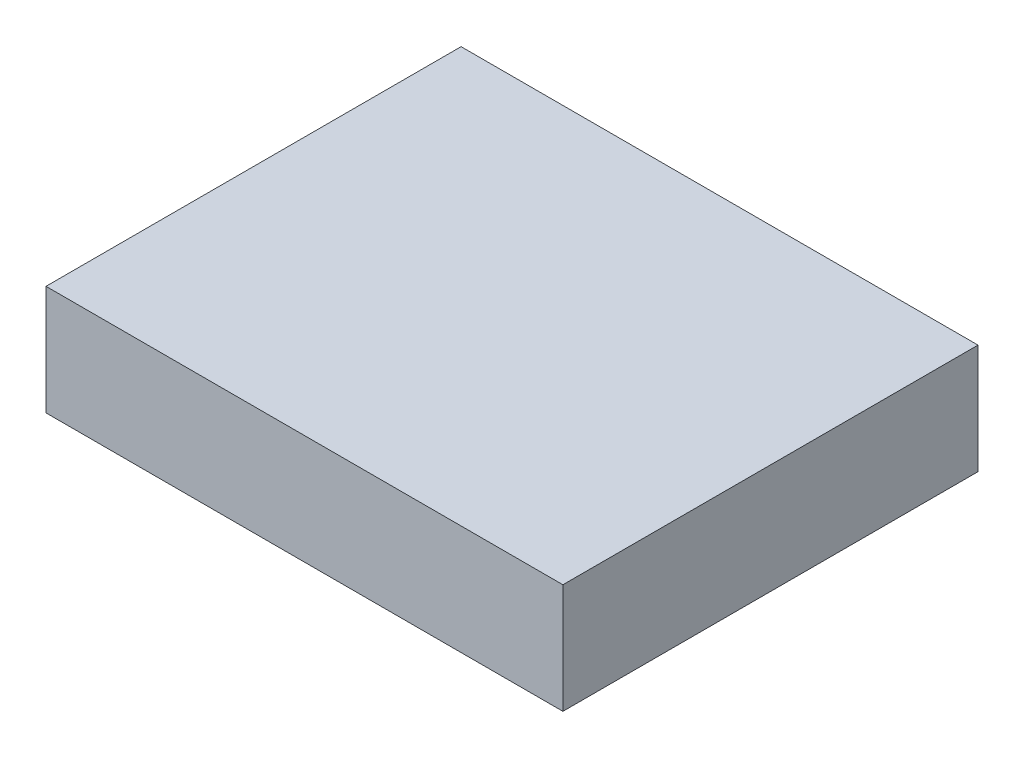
from build123d import *

# Parameters (mm, degrees)
SKETCH1_W           = 66
SKETCH1_H           = 53
BOSS_EXTRUDE1_DEPTH = 14


with BuildPart() as part:
    # Sketch1 → Boss-Extrude1 (new body)
    with BuildSketch(Plane(origin=(0, 0, 0), x_dir=(1, 0, 0), z_dir=(0, 1, 0))):
        with Locations((33, 26.5)):
            Rectangle(SKETCH1_W, SKETCH1_H)
    extrude(amount=BOSS_EXTRUDE1_DEPTH)


solid = part.part
